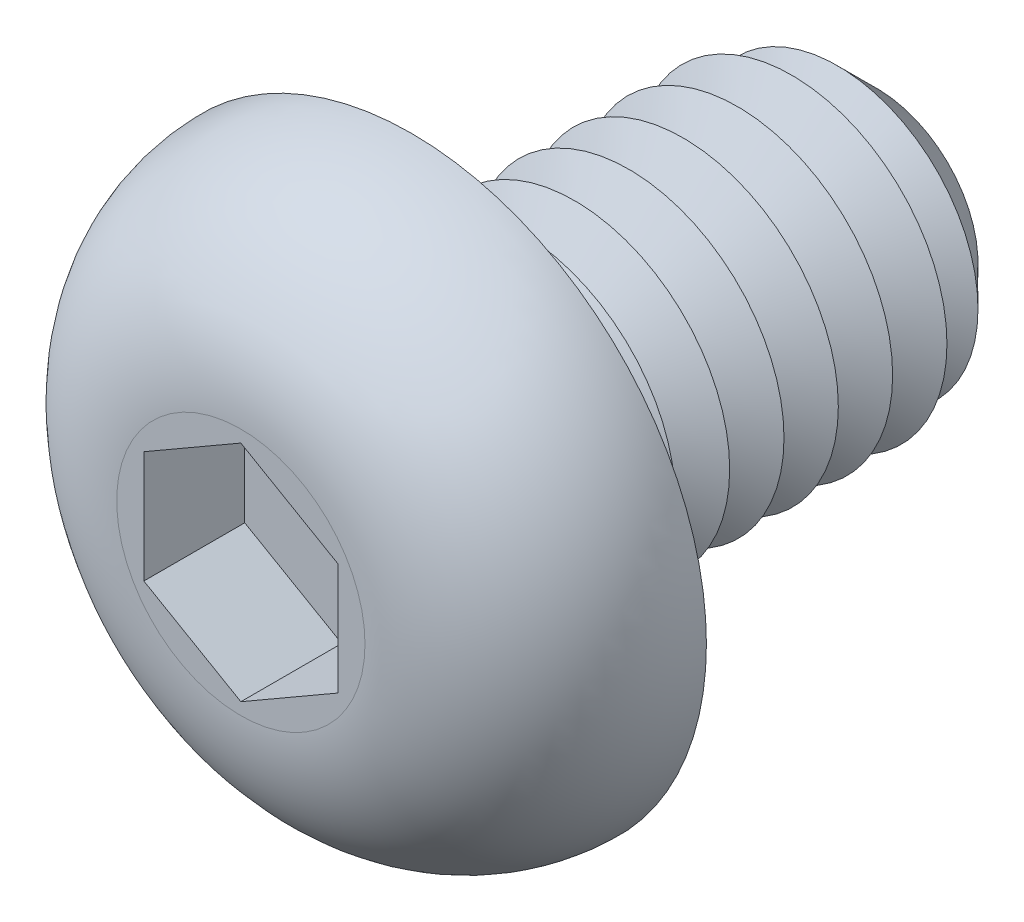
from build123d import *

# Parameters (mm, degrees)
CUT_EXTRUDE1_DEPTH  = 1.3
SKETCH4_R           = 2
BOSS_EXTRUDE1_DEPTH = 6
CHAMFER1_SIZE       = 0.7
LPATTERN1_COUNT     = 7
LPATTERN1_PITCH     = 0.7
FILLET2_R           = 0.35
SKETCH6_R           = 0.5
CUT_EXTRUDE2_DEPTH  = 6.9


with BuildPart() as part:
    # Sketch2 → Revolve1 (revolve)
    with BuildSketch(Plane(origin=(0, 0, 0), x_dir=(0, 0, -1), z_dir=(1, 0, 0)), mode=Mode.PRIVATE) as revolve1_sk:
        with BuildLine():
            Line((0, 0), (-2.2, 0))
            Line((-2.2, 0), (-2.2, 1.6))
            ThreePointArc((-2.2, 1.6), (-1.555634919, 3.155634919), (0, 3.8))
            Line((0, 3.8), (0, 0))
        make_face()
    revolve(revolve1_sk.sketch.rotate(Axis((0, 0, 47.934239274), (0, 0, -1)), 90), axis=Axis((0, 0, 47.934239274), (0, 0, -1)))

    # Sketch3 → Cut-Extrude1 (cut)
    with BuildSketch(Plane.XY.offset(2.2)):
        Polygon((0, 1.443375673), (-1.25, 0.721687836), (-1.25, -0.721687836), (0, -1.443375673), (1.25, -0.721687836), (1.25, 0.721687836), align=None)
    extrude(amount=-CUT_EXTRUDE1_DEPTH, mode=Mode.SUBTRACT)

    # Sketch4 → Boss-Extrude1 (add)
    with BuildSketch(Plane(origin=(0, 0, 0), x_dir=(-1, 0, 0), z_dir=(0, 0, -1))):
        with Locations(Location((0, 0, 0), (0, 0, 180))):
            Circle(SKETCH4_R)
    extrude(amount=BOSS_EXTRUDE1_DEPTH)

    # Chamfer1
    chamfer1_edges = [part.edges().sort_by_distance(p)[0] for p in [
        (-2, 0, -6),
    ]]
    chamfer(chamfer1_edges, length=CHAMFER1_SIZE)

    # Sketch5 → Cut-Revolve1 (revolve, cut)
    with BuildSketch(Plane(origin=(0, 0, 0), x_dir=(0, 0, -1), z_dir=(1, 0, 0)), mode=Mode.PRIVATE) as cut_revolve1_sk:
        Polygon((0.7, 2), (1.4, 2), (1.05, 1.393782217), align=None)
    cut_revolve1 = revolve(cut_revolve1_sk.sketch.rotate(Axis((0, 0, 47.934239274), (0, 0, -1)), 90), axis=Axis((0, 0, 47.934239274), (0, 0, -1)), mode=Mode.SUBTRACT)

    # LPattern1: Cut-Revolve1 ×7
    with Locations(*[(0, 0, -i * LPATTERN1_PITCH) for i in range(1, LPATTERN1_COUNT)]):
        add(cut_revolve1, mode=Mode.SUBTRACT)

    # Fillet2
    fillet2_edges = [part.edges().sort_by_distance(p)[0] for p in [
        (-2, 0, 0),
    ]]
    fillet(fillet2_edges, radius=FILLET2_R)

    # Sketch6 → Cut-Extrude2 (cut)
    with BuildSketch(Plane.XY.offset(0.9)):
        Circle(SKETCH6_R)
    extrude(amount=-CUT_EXTRUDE2_DEPTH, mode=Mode.SUBTRACT)


solid = part.part
